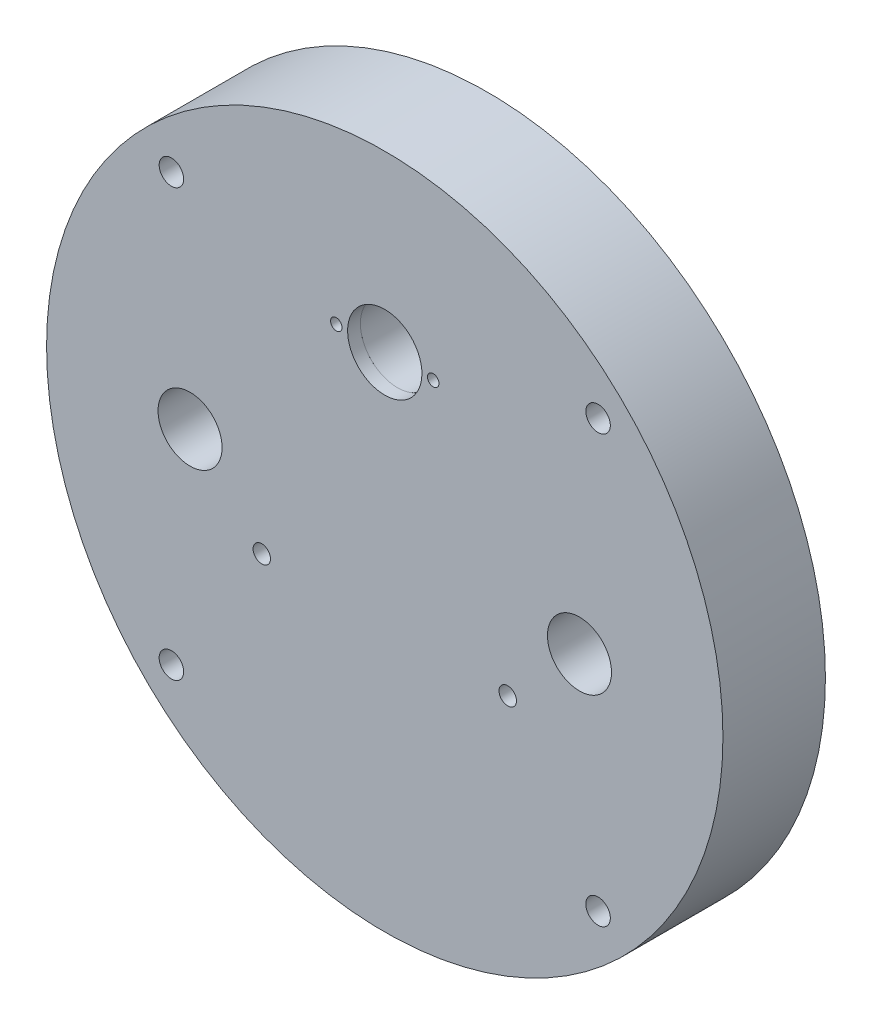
ISO-10303-21;
HEADER;
FILE_DESCRIPTION(('STEP AP214'),'2;1');
FILE_NAME('part.step','',(''),(''),'','','');
FILE_SCHEMA(('AUTOMOTIVE_DESIGN { 1 0 10303 214 1 1 1 1 }'));
ENDSEC;
DATA;
#1=APPLICATION_CONTEXT('core data for automotive mechanical design processes');
#2=APPLICATION_PROTOCOL_DEFINITION('international standard','automotive_design',2000,#1);
#3=PRODUCT_CONTEXT('',#1,'mechanical');
#4=PRODUCT('Part','Part','',(#3));
#5=PRODUCT_RELATED_PRODUCT_CATEGORY('part','',(#4));
#6=PRODUCT_DEFINITION_FORMATION('','',#4);
#7=PRODUCT_DEFINITION_CONTEXT('part definition',#1,'design');
#8=PRODUCT_DEFINITION('design','',#6,#7);
#9=PRODUCT_DEFINITION_SHAPE('','',#8);
#10=(LENGTH_UNIT() NAMED_UNIT(*) SI_UNIT(.MILLI.,.METRE.));
#11=(NAMED_UNIT(*) PLANE_ANGLE_UNIT() SI_UNIT($,.RADIAN.));
#12=(NAMED_UNIT(*) SI_UNIT($,.STERADIAN.) SOLID_ANGLE_UNIT());
#13=UNCERTAINTY_MEASURE_WITH_UNIT(LENGTH_MEASURE(1.E-05),#10,'distance_accuracy_value','');
#14=(GEOMETRIC_REPRESENTATION_CONTEXT(3) GLOBAL_UNCERTAINTY_ASSIGNED_CONTEXT((#13)) GLOBAL_UNIT_ASSIGNED_CONTEXT((#10,
#11,#12)) REPRESENTATION_CONTEXT('',''));
#15=CARTESIAN_POINT('',(0.,0.,0.));
#16=DIRECTION('',(0.,0.,1.));
#17=DIRECTION('',(1.,0.,0.));
#18=AXIS2_PLACEMENT_3D('',#15,#16,#17);
#19=CARTESIAN_POINT('',(0.,0.,15.875));
#20=DIRECTION('',(0.,0.,-1.));
#21=DIRECTION('',(-1.,0.,0.));
#22=AXIS2_PLACEMENT_3D('',#19,#20,#21);
#23=CYLINDRICAL_SURFACE('',#22,52.3875);
#24=CARTESIAN_POINT('',(0.,0.,15.875));
#25=DIRECTION('',(0.,0.,1.));
#26=DIRECTION('',(1.,0.,0.));
#27=AXIS2_PLACEMENT_3D('',#24,#25,#26);
#28=CIRCLE('',#27,52.3875);
#29=CARTESIAN_POINT('',(52.3875,0.,15.875));
#30=VERTEX_POINT('',#29);
#31=EDGE_CURVE('E11',#30,#30,#28,.T.);
#32=ORIENTED_EDGE('',*,*,#31,.F.);
#33=EDGE_LOOP('',(#32));
#34=FACE_BOUND('',#33,.T.);
#35=CARTESIAN_POINT('',(0.,0.,0.));
#36=DIRECTION('',(0.,0.,1.));
#37=DIRECTION('',(1.,0.,0.));
#38=AXIS2_PLACEMENT_3D('',#35,#36,#37);
#39=CIRCLE('',#38,52.3875);
#40=CARTESIAN_POINT('',(52.3875,0.,0.));
#41=VERTEX_POINT('',#40);
#42=EDGE_CURVE('E42',#41,#41,#39,.T.);
#43=ORIENTED_EDGE('',*,*,#42,.T.);
#44=EDGE_LOOP('',(#43));
#45=FACE_BOUND('',#44,.T.);
#46=ADVANCED_FACE('F39',(#34,#45),#23,.T.);
#47=CARTESIAN_POINT('',(0.,0.,15.875));
#48=DIRECTION('',(0.,0.,1.));
#49=DIRECTION('',(1.,0.,0.));
#50=AXIS2_PLACEMENT_3D('',#47,#48,#49);
#51=PLANE('',#50);
#52=CARTESIAN_POINT('',(-7.5057,25.4,15.875));
#53=DIRECTION('',(0.,0.,1.));
#54=DIRECTION('',(1.,0.,0.));
#55=AXIS2_PLACEMENT_3D('',#52,#53,#54);
#56=CIRCLE('',#55,0.888999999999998);
#57=CARTESIAN_POINT('',(-6.6167,25.4,15.875));
#58=VERTEX_POINT('',#57);
#59=EDGE_CURVE('E79',#58,#58,#56,.T.);
#60=ORIENTED_EDGE('',*,*,#59,.F.);
#61=EDGE_LOOP('',(#60));
#62=FACE_BOUND('',#61,.T.);
#63=CARTESIAN_POINT('',(7.5057,25.4,15.875));
#64=DIRECTION('',(0.,0.,1.));
#65=DIRECTION('',(1.,0.,0.));
#66=AXIS2_PLACEMENT_3D('',#63,#64,#65);
#67=CIRCLE('',#66,0.888999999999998);
#68=CARTESIAN_POINT('',(8.3947,25.4,15.875));
#69=VERTEX_POINT('',#68);
#70=EDGE_CURVE('E78',#69,#69,#67,.T.);
#71=ORIENTED_EDGE('',*,*,#70,.F.);
#72=EDGE_LOOP('',(#71));
#73=FACE_BOUND('',#72,.T.);
#74=CARTESIAN_POINT('',(0.,25.4,15.875));
#75=DIRECTION('',(0.,0.,-1.));
#76=DIRECTION('',(0.,1.,0.));
#77=AXIS2_PLACEMENT_3D('',#74,#75,#76);
#78=CIRCLE('',#77,5.7546875);
#79=CARTESIAN_POINT('',(0.,31.1546875,15.875));
#80=VERTEX_POINT('',#79);
#81=EDGE_CURVE('E90',#80,#80,#78,.T.);
#82=ORIENTED_EDGE('',*,*,#81,.T.);
#83=EDGE_LOOP('',(#82));
#84=FACE_BOUND('',#83,.T.);
#85=CARTESIAN_POINT('',(-19.05,-11.16584,15.875));
#86=DIRECTION('',(0.,0.,1.));
#87=DIRECTION('',(1.,0.,0.));
#88=AXIS2_PLACEMENT_3D('',#85,#86,#87);
#89=CIRCLE('',#88,1.35255);
#90=CARTESIAN_POINT('',(-17.69745,-11.16584,15.875));
#91=VERTEX_POINT('',#90);
#92=EDGE_CURVE('E107',#91,#91,#89,.T.);
#93=ORIENTED_EDGE('',*,*,#92,.F.);
#94=EDGE_LOOP('',(#93));
#95=FACE_BOUND('',#94,.T.);
#96=CARTESIAN_POINT('',(19.05,-11.16584,15.875));
#97=DIRECTION('',(0.,0.,1.));
#98=DIRECTION('',(1.,0.,0.));
#99=AXIS2_PLACEMENT_3D('',#96,#97,#98);
#100=CIRCLE('',#99,1.35255);
#101=CARTESIAN_POINT('',(20.40255,-11.16584,15.875));
#102=VERTEX_POINT('',#101);
#103=EDGE_CURVE('E113',#102,#102,#100,.T.);
#104=ORIENTED_EDGE('',*,*,#103,.F.);
#105=EDGE_LOOP('',(#104));
#106=FACE_BOUND('',#105,.T.);
#107=CARTESIAN_POINT('',(-30.1625,0.,15.875));
#108=DIRECTION('',(0.,0.,1.));
#109=DIRECTION('',(1.,0.,0.));
#110=AXIS2_PLACEMENT_3D('',#107,#108,#109);
#111=CIRCLE('',#110,4.96061999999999);
#112=CARTESIAN_POINT('',(-25.20188,0.,15.875));
#113=VERTEX_POINT('',#112);
#114=EDGE_CURVE('E137',#113,#113,#111,.T.);
#115=ORIENTED_EDGE('',*,*,#114,.F.);
#116=EDGE_LOOP('',(#115));
#117=FACE_BOUND('',#116,.T.);
#118=CARTESIAN_POINT('',(30.1625,0.,15.875));
#119=DIRECTION('',(0.,0.,1.));
#120=DIRECTION('',(1.,0.,0.));
#121=AXIS2_PLACEMENT_3D('',#118,#119,#120);
#122=CIRCLE('',#121,4.96061999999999);
#123=CARTESIAN_POINT('',(35.12312,0.,15.875));
#124=VERTEX_POINT('',#123);
#125=EDGE_CURVE('E143',#124,#124,#122,.T.);
#126=ORIENTED_EDGE('',*,*,#125,.F.);
#127=EDGE_LOOP('',(#126));
#128=FACE_BOUND('',#127,.T.);
#129=CARTESIAN_POINT('',(-33.0473425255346,-33.0473425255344,15.875));
#130=DIRECTION('',(0.,0.,-1.));
#131=DIRECTION('',(-1.,0.,0.));
#132=AXIS2_PLACEMENT_3D('',#129,#130,#131);
#133=CIRCLE('',#132,1.89864999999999);
#134=CARTESIAN_POINT('',(-34.9459925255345,-33.0473425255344,15.875));
#135=VERTEX_POINT('',#134);
#136=EDGE_CURVE('E152',#135,#135,#133,.T.);
#137=ORIENTED_EDGE('',*,*,#136,.T.);
#138=EDGE_LOOP('',(#137));
#139=FACE_BOUND('',#138,.T.);
#140=CARTESIAN_POINT('',(33.0473425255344,-33.0473425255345,15.875));
#141=DIRECTION('',(0.,0.,-1.));
#142=DIRECTION('',(-1.,0.,0.));
#143=AXIS2_PLACEMENT_3D('',#140,#141,#142);
#144=CIRCLE('',#143,1.89864999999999);
#145=CARTESIAN_POINT('',(31.1486925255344,-33.0473425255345,15.875));
#146=VERTEX_POINT('',#145);
#147=EDGE_CURVE('E158',#146,#146,#144,.T.);
#148=ORIENTED_EDGE('',*,*,#147,.T.);
#149=EDGE_LOOP('',(#148));
#150=FACE_BOUND('',#149,.T.);
#151=CARTESIAN_POINT('',(33.0473425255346,33.0473425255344,15.875));
#152=DIRECTION('',(0.,0.,-1.));
#153=DIRECTION('',(-1.,0.,0.));
#154=AXIS2_PLACEMENT_3D('',#151,#152,#153);
#155=CIRCLE('',#154,1.89864999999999);
#156=CARTESIAN_POINT('',(31.1486925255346,33.0473425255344,15.875));
#157=VERTEX_POINT('',#156);
#158=EDGE_CURVE('E164',#157,#157,#155,.T.);
#159=ORIENTED_EDGE('',*,*,#158,.T.);
#160=EDGE_LOOP('',(#159));
#161=FACE_BOUND('',#160,.T.);
#162=CARTESIAN_POINT('',(-33.0473425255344,33.0473425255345,15.875));
#163=DIRECTION('',(0.,0.,-1.));
#164=DIRECTION('',(-1.,0.,0.));
#165=AXIS2_PLACEMENT_3D('',#162,#163,#164);
#166=CIRCLE('',#165,1.89864999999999);
#167=CARTESIAN_POINT('',(-34.9459925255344,33.0473425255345,15.875));
#168=VERTEX_POINT('',#167);
#169=EDGE_CURVE('E170',#168,#168,#166,.T.);
#170=ORIENTED_EDGE('',*,*,#169,.T.);
#171=EDGE_LOOP('',(#170));
#172=FACE_BOUND('',#171,.T.);
#173=ORIENTED_EDGE('',*,*,#31,.T.);
#174=EDGE_LOOP('',(#173));
#175=FACE_BOUND('',#174,.T.);
#176=ADVANCED_FACE('F181',(#62,#73,#84,#95,#106,#117,#128,#139,#150,#161,#172,#175),#51,.T.);
#177=CARTESIAN_POINT('',(0.,0.,0.));
#178=DIRECTION('',(0.,0.,1.));
#179=DIRECTION('',(1.,0.,0.));
#180=AXIS2_PLACEMENT_3D('',#177,#178,#179);
#181=PLANE('',#180);
#182=CARTESIAN_POINT('',(0.,25.4,0.));
#183=DIRECTION('',(0.,0.,-1.));
#184=DIRECTION('',(-1.,0.,0.));
#185=AXIS2_PLACEMENT_3D('',#182,#183,#184);
#186=CIRCLE('',#185,6.985);
#187=CARTESIAN_POINT('',(-6.985,25.4,0.));
#188=VERTEX_POINT('',#187);
#189=EDGE_CURVE('E98',#188,#188,#186,.T.);
#190=ORIENTED_EDGE('',*,*,#189,.F.);
#191=EDGE_LOOP('',(#190));
#192=FACE_BOUND('',#191,.T.);
#193=CARTESIAN_POINT('',(19.05,-31.7499999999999,0.));
#194=DIRECTION('',(0.,0.,-1.));
#195=DIRECTION('',(-1.,0.,0.));
#196=AXIS2_PLACEMENT_3D('',#193,#194,#195);
#197=CIRCLE('',#196,2.5527);
#198=CARTESIAN_POINT('',(16.4973,-31.7499999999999,0.));
#199=VERTEX_POINT('',#198);
#200=EDGE_CURVE('E119',#199,#199,#197,.T.);
#201=ORIENTED_EDGE('',*,*,#200,.F.);
#202=EDGE_LOOP('',(#201));
#203=FACE_BOUND('',#202,.T.);
#204=CARTESIAN_POINT('',(0.,-31.75,0.));
#205=DIRECTION('',(0.,0.,-1.));
#206=DIRECTION('',(-1.,0.,0.));
#207=AXIS2_PLACEMENT_3D('',#204,#205,#206);
#208=CIRCLE('',#207,2.5527);
#209=CARTESIAN_POINT('',(-2.55270000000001,-31.75,0.));
#210=VERTEX_POINT('',#209);
#211=EDGE_CURVE('E125',#210,#210,#208,.T.);
#212=ORIENTED_EDGE('',*,*,#211,.F.);
#213=EDGE_LOOP('',(#212));
#214=FACE_BOUND('',#213,.T.);
#215=CARTESIAN_POINT('',(-19.05,-31.7500000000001,0.));
#216=DIRECTION('',(0.,0.,-1.));
#217=DIRECTION('',(-1.,0.,0.));
#218=AXIS2_PLACEMENT_3D('',#215,#216,#217);
#219=CIRCLE('',#218,2.5527);
#220=CARTESIAN_POINT('',(-21.6027,-31.7500000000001,0.));
#221=VERTEX_POINT('',#220);
#222=EDGE_CURVE('E131',#221,#221,#219,.T.);
#223=ORIENTED_EDGE('',*,*,#222,.F.);
#224=EDGE_LOOP('',(#223));
#225=FACE_BOUND('',#224,.T.);
#226=CARTESIAN_POINT('',(-30.1625,0.,0.));
#227=DIRECTION('',(0.,0.,1.));
#228=DIRECTION('',(1.,0.,0.));
#229=AXIS2_PLACEMENT_3D('',#226,#227,#228);
#230=CIRCLE('',#229,4.96061999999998);
#231=CARTESIAN_POINT('',(-25.20188,0.,0.));
#232=VERTEX_POINT('',#231);
#233=EDGE_CURVE('E140',#232,#232,#230,.T.);
#234=ORIENTED_EDGE('',*,*,#233,.T.);
#235=EDGE_LOOP('',(#234));
#236=FACE_BOUND('',#235,.T.);
#237=CARTESIAN_POINT('',(30.1625,0.,0.));
#238=DIRECTION('',(0.,0.,1.));
#239=DIRECTION('',(1.,0.,0.));
#240=AXIS2_PLACEMENT_3D('',#237,#238,#239);
#241=CIRCLE('',#240,4.96061999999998);
#242=CARTESIAN_POINT('',(35.12312,0.,0.));
#243=VERTEX_POINT('',#242);
#244=EDGE_CURVE('E146',#243,#243,#241,.T.);
#245=ORIENTED_EDGE('',*,*,#244,.T.);
#246=EDGE_LOOP('',(#245));
#247=FACE_BOUND('',#246,.T.);
#248=CARTESIAN_POINT('',(-33.0473425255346,-33.0473425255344,0.));
#249=DIRECTION('',(0.,0.,-1.));
#250=DIRECTION('',(-1.,0.,0.));
#251=AXIS2_PLACEMENT_3D('',#248,#249,#250);
#252=CIRCLE('',#251,1.89865);
#253=CARTESIAN_POINT('',(-34.9459925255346,-33.0473425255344,0.));
#254=VERTEX_POINT('',#253);
#255=EDGE_CURVE('E149',#254,#254,#252,.T.);
#256=ORIENTED_EDGE('',*,*,#255,.F.);
#257=EDGE_LOOP('',(#256));
#258=FACE_BOUND('',#257,.T.);
#259=CARTESIAN_POINT('',(33.0473425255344,-33.0473425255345,0.));
#260=DIRECTION('',(0.,0.,-1.));
#261=DIRECTION('',(-1.,0.,0.));
#262=AXIS2_PLACEMENT_3D('',#259,#260,#261);
#263=CIRCLE('',#262,1.89864999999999);
#264=CARTESIAN_POINT('',(31.1486925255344,-33.0473425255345,0.));
#265=VERTEX_POINT('',#264);
#266=EDGE_CURVE('E155',#265,#265,#263,.T.);
#267=ORIENTED_EDGE('',*,*,#266,.F.);
#268=EDGE_LOOP('',(#267));
#269=FACE_BOUND('',#268,.T.);
#270=CARTESIAN_POINT('',(33.0473425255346,33.0473425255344,0.));
#271=DIRECTION('',(0.,0.,-1.));
#272=DIRECTION('',(-1.,0.,0.));
#273=AXIS2_PLACEMENT_3D('',#270,#271,#272);
#274=CIRCLE('',#273,1.89864999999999);
#275=CARTESIAN_POINT('',(31.1486925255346,33.0473425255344,0.));
#276=VERTEX_POINT('',#275);
#277=EDGE_CURVE('E161',#276,#276,#274,.T.);
#278=ORIENTED_EDGE('',*,*,#277,.F.);
#279=EDGE_LOOP('',(#278));
#280=FACE_BOUND('',#279,.T.);
#281=CARTESIAN_POINT('',(-33.0473425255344,33.0473425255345,0.));
#282=DIRECTION('',(0.,0.,-1.));
#283=DIRECTION('',(-1.,0.,0.));
#284=AXIS2_PLACEMENT_3D('',#281,#282,#283);
#285=CIRCLE('',#284,1.89865);
#286=CARTESIAN_POINT('',(-34.9459925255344,33.0473425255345,0.));
#287=VERTEX_POINT('',#286);
#288=EDGE_CURVE('E167',#287,#287,#285,.T.);
#289=ORIENTED_EDGE('',*,*,#288,.F.);
#290=EDGE_LOOP('',(#289));
#291=FACE_BOUND('',#290,.T.);
#292=ORIENTED_EDGE('',*,*,#42,.F.);
#293=EDGE_LOOP('',(#292));
#294=FACE_BOUND('',#293,.T.);
#295=ADVANCED_FACE('F178',(#192,#203,#214,#225,#236,#247,#258,#269,#280,#291,#294),#181,.F.);
#296=CARTESIAN_POINT('',(-33.0473425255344,33.0473425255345,0.));
#297=DIRECTION('',(0.,0.,-1.));
#298=DIRECTION('',(-1.,0.,0.));
#299=AXIS2_PLACEMENT_3D('',#296,#297,#298);
#300=CYLINDRICAL_SURFACE('',#299,1.89865);
#301=ORIENTED_EDGE('',*,*,#169,.F.);
#302=EDGE_LOOP('',(#301));
#303=FACE_BOUND('',#302,.T.);
#304=ORIENTED_EDGE('',*,*,#288,.T.);
#305=EDGE_LOOP('',(#304));
#306=FACE_BOUND('',#305,.T.);
#307=ADVANCED_FACE('F180',(#303,#306),#300,.F.);
#308=CARTESIAN_POINT('',(33.0473425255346,33.0473425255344,0.));
#309=DIRECTION('',(0.,0.,-1.));
#310=DIRECTION('',(-1.,0.,0.));
#311=AXIS2_PLACEMENT_3D('',#308,#309,#310);
#312=CYLINDRICAL_SURFACE('',#311,1.89864999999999);
#313=ORIENTED_EDGE('',*,*,#158,.F.);
#314=EDGE_LOOP('',(#313));
#315=FACE_BOUND('',#314,.T.);
#316=ORIENTED_EDGE('',*,*,#277,.T.);
#317=EDGE_LOOP('',(#316));
#318=FACE_BOUND('',#317,.T.);
#319=ADVANCED_FACE('F187',(#315,#318),#312,.F.);
#320=CARTESIAN_POINT('',(33.0473425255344,-33.0473425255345,0.));
#321=DIRECTION('',(0.,0.,-1.));
#322=DIRECTION('',(-1.,0.,0.));
#323=AXIS2_PLACEMENT_3D('',#320,#321,#322);
#324=CYLINDRICAL_SURFACE('',#323,1.89864999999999);
#325=ORIENTED_EDGE('',*,*,#147,.F.);
#326=EDGE_LOOP('',(#325));
#327=FACE_BOUND('',#326,.T.);
#328=ORIENTED_EDGE('',*,*,#266,.T.);
#329=EDGE_LOOP('',(#328));
#330=FACE_BOUND('',#329,.T.);
#331=ADVANCED_FACE('F319',(#327,#330),#324,.F.);
#332=CARTESIAN_POINT('',(-33.0473425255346,-33.0473425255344,0.));
#333=DIRECTION('',(0.,0.,-1.));
#334=DIRECTION('',(-1.,0.,0.));
#335=AXIS2_PLACEMENT_3D('',#332,#333,#334);
#336=CYLINDRICAL_SURFACE('',#335,1.89865);
#337=ORIENTED_EDGE('',*,*,#136,.F.);
#338=EDGE_LOOP('',(#337));
#339=FACE_BOUND('',#338,.T.);
#340=ORIENTED_EDGE('',*,*,#255,.T.);
#341=EDGE_LOOP('',(#340));
#342=FACE_BOUND('',#341,.T.);
#343=ADVANCED_FACE('F315',(#339,#342),#336,.F.);
#344=CARTESIAN_POINT('',(30.1625,0.,15.875));
#345=DIRECTION('',(0.,0.,1.));
#346=DIRECTION('',(1.,0.,0.));
#347=AXIS2_PLACEMENT_3D('',#344,#345,#346);
#348=CYLINDRICAL_SURFACE('',#347,4.96061999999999);
#349=ORIENTED_EDGE('',*,*,#244,.F.);
#350=EDGE_LOOP('',(#349));
#351=FACE_BOUND('',#350,.T.);
#352=ORIENTED_EDGE('',*,*,#125,.T.);
#353=EDGE_LOOP('',(#352));
#354=FACE_BOUND('',#353,.T.);
#355=ADVANCED_FACE('F311',(#351,#354),#348,.F.);
#356=CARTESIAN_POINT('',(-30.1625,0.,15.875));
#357=DIRECTION('',(0.,0.,1.));
#358=DIRECTION('',(1.,0.,0.));
#359=AXIS2_PLACEMENT_3D('',#356,#357,#358);
#360=CYLINDRICAL_SURFACE('',#359,4.96061999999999);
#361=ORIENTED_EDGE('',*,*,#233,.F.);
#362=EDGE_LOOP('',(#361));
#363=FACE_BOUND('',#362,.T.);
#364=ORIENTED_EDGE('',*,*,#114,.T.);
#365=EDGE_LOOP('',(#364));
#366=FACE_BOUND('',#365,.T.);
#367=ADVANCED_FACE('F308',(#363,#366),#360,.F.);
#368=CARTESIAN_POINT('',(-19.05,-31.7500000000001,12.7));
#369=DIRECTION('',(0.,0.,-1.));
#370=DIRECTION('',(-1.,0.,0.));
#371=AXIS2_PLACEMENT_3D('',#368,#369,#370);
#372=CONICAL_SURFACE('',#371,2.5527,1.02974425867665);
#373=CARTESIAN_POINT('',(-19.05,-31.7500000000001,14.2338169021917));
#374=VERTEX_POINT('',#373);
#375=VERTEX_LOOP('',#374);
#376=FACE_BOUND('',#375,.T.);
#377=CARTESIAN_POINT('',(-19.05,-31.7500000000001,12.7));
#378=DIRECTION('',(0.,0.,-1.));
#379=DIRECTION('',(-1.,0.,0.));
#380=AXIS2_PLACEMENT_3D('',#377,#378,#379);
#381=CIRCLE('',#380,2.5527);
#382=CARTESIAN_POINT('',(-21.6027,-31.7500000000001,12.7));
#383=VERTEX_POINT('',#382);
#384=EDGE_CURVE('E134',#383,#383,#381,.T.);
#385=ORIENTED_EDGE('',*,*,#384,.T.);
#386=EDGE_LOOP('',(#385));
#387=FACE_BOUND('',#386,.T.);
#388=ADVANCED_FACE('F304',(#376,#387),#372,.F.);
#389=CARTESIAN_POINT('',(-19.05,-31.7500000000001,0.));
#390=DIRECTION('',(0.,0.,-1.));
#391=DIRECTION('',(-1.,0.,0.));
#392=AXIS2_PLACEMENT_3D('',#389,#390,#391);
#393=CYLINDRICAL_SURFACE('',#392,2.5527);
#394=ORIENTED_EDGE('',*,*,#384,.F.);
#395=EDGE_LOOP('',(#394));
#396=FACE_BOUND('',#395,.T.);
#397=ORIENTED_EDGE('',*,*,#222,.T.);
#398=EDGE_LOOP('',(#397));
#399=FACE_BOUND('',#398,.T.);
#400=ADVANCED_FACE('F301',(#396,#399),#393,.F.);
#401=CARTESIAN_POINT('',(0.,-31.75,12.7));
#402=DIRECTION('',(0.,0.,-1.));
#403=DIRECTION('',(-1.,0.,0.));
#404=AXIS2_PLACEMENT_3D('',#401,#402,#403);
#405=CONICAL_SURFACE('',#404,2.5527,1.02974425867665);
#406=CARTESIAN_POINT('',(0.,-31.75,14.2338169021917));
#407=VERTEX_POINT('',#406);
#408=VERTEX_LOOP('',#407);
#409=FACE_BOUND('',#408,.T.);
#410=CARTESIAN_POINT('',(0.,-31.75,12.7));
#411=DIRECTION('',(0.,0.,-1.));
#412=DIRECTION('',(-1.,0.,0.));
#413=AXIS2_PLACEMENT_3D('',#410,#411,#412);
#414=CIRCLE('',#413,2.5527);
#415=CARTESIAN_POINT('',(-2.5527,-31.75,12.7));
#416=VERTEX_POINT('',#415);
#417=EDGE_CURVE('E128',#416,#416,#414,.T.);
#418=ORIENTED_EDGE('',*,*,#417,.T.);
#419=EDGE_LOOP('',(#418));
#420=FACE_BOUND('',#419,.T.);
#421=ADVANCED_FACE('F297',(#409,#420),#405,.F.);
#422=CARTESIAN_POINT('',(0.,-31.75,0.));
#423=DIRECTION('',(0.,0.,-1.));
#424=DIRECTION('',(-1.,0.,0.));
#425=AXIS2_PLACEMENT_3D('',#422,#423,#424);
#426=CYLINDRICAL_SURFACE('',#425,2.5527);
#427=ORIENTED_EDGE('',*,*,#417,.F.);
#428=EDGE_LOOP('',(#427));
#429=FACE_BOUND('',#428,.T.);
#430=ORIENTED_EDGE('',*,*,#211,.T.);
#431=EDGE_LOOP('',(#430));
#432=FACE_BOUND('',#431,.T.);
#433=ADVANCED_FACE('F293',(#429,#432),#426,.F.);
#434=CARTESIAN_POINT('',(19.05,-31.7499999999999,12.7));
#435=DIRECTION('',(0.,0.,-1.));
#436=DIRECTION('',(-1.,0.,0.));
#437=AXIS2_PLACEMENT_3D('',#434,#435,#436);
#438=CONICAL_SURFACE('',#437,2.5527,1.02974425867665);
#439=CARTESIAN_POINT('',(19.05,-31.7499999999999,14.2338169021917));
#440=VERTEX_POINT('',#439);
#441=VERTEX_LOOP('',#440);
#442=FACE_BOUND('',#441,.T.);
#443=CARTESIAN_POINT('',(19.05,-31.7499999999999,12.7));
#444=DIRECTION('',(0.,0.,-1.));
#445=DIRECTION('',(-1.,0.,0.));
#446=AXIS2_PLACEMENT_3D('',#443,#444,#445);
#447=CIRCLE('',#446,2.5527);
#448=CARTESIAN_POINT('',(16.4973,-31.7499999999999,12.7));
#449=VERTEX_POINT('',#448);
#450=EDGE_CURVE('E122',#449,#449,#447,.T.);
#451=ORIENTED_EDGE('',*,*,#450,.T.);
#452=EDGE_LOOP('',(#451));
#453=FACE_BOUND('',#452,.T.);
#454=ADVANCED_FACE('F289',(#442,#453),#438,.F.);
#455=CARTESIAN_POINT('',(19.05,-31.7499999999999,0.));
#456=DIRECTION('',(0.,0.,-1.));
#457=DIRECTION('',(-1.,0.,0.));
#458=AXIS2_PLACEMENT_3D('',#455,#456,#457);
#459=CYLINDRICAL_SURFACE('',#458,2.5527);
#460=ORIENTED_EDGE('',*,*,#450,.F.);
#461=EDGE_LOOP('',(#460));
#462=FACE_BOUND('',#461,.T.);
#463=ORIENTED_EDGE('',*,*,#200,.T.);
#464=EDGE_LOOP('',(#463));
#465=FACE_BOUND('',#464,.T.);
#466=ADVANCED_FACE('F285',(#462,#465),#459,.F.);
#467=CARTESIAN_POINT('',(19.05,-11.16584,3.175));
#468=DIRECTION('',(0.,0.,1.));
#469=DIRECTION('',(1.,0.,0.));
#470=AXIS2_PLACEMENT_3D('',#467,#468,#469);
#471=CONICAL_SURFACE('',#470,1.35255,1.02974425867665);
#472=CARTESIAN_POINT('',(19.05,-11.16584,2.36230596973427));
#473=VERTEX_POINT('',#472);
#474=VERTEX_LOOP('',#473);
#475=FACE_BOUND('',#474,.T.);
#476=CARTESIAN_POINT('',(19.05,-11.16584,3.175));
#477=DIRECTION('',(0.,0.,1.));
#478=DIRECTION('',(1.,0.,0.));
#479=AXIS2_PLACEMENT_3D('',#476,#477,#478);
#480=CIRCLE('',#479,1.35255);
#481=CARTESIAN_POINT('',(20.40255,-11.16584,3.175));
#482=VERTEX_POINT('',#481);
#483=EDGE_CURVE('E116',#482,#482,#480,.T.);
#484=ORIENTED_EDGE('',*,*,#483,.T.);
#485=EDGE_LOOP('',(#484));
#486=FACE_BOUND('',#485,.T.);
#487=ADVANCED_FACE('F281',(#475,#486),#471,.F.);
#488=CARTESIAN_POINT('',(19.05,-11.16584,15.875));
#489=DIRECTION('',(0.,0.,1.));
#490=DIRECTION('',(1.,0.,0.));
#491=AXIS2_PLACEMENT_3D('',#488,#489,#490);
#492=CYLINDRICAL_SURFACE('',#491,1.35255);
#493=ORIENTED_EDGE('',*,*,#483,.F.);
#494=EDGE_LOOP('',(#493));
#495=FACE_BOUND('',#494,.T.);
#496=ORIENTED_EDGE('',*,*,#103,.T.);
#497=EDGE_LOOP('',(#496));
#498=FACE_BOUND('',#497,.T.);
#499=ADVANCED_FACE('F277',(#495,#498),#492,.F.);
#500=CARTESIAN_POINT('',(-19.05,-11.16584,3.175));
#501=DIRECTION('',(0.,0.,1.));
#502=DIRECTION('',(1.,0.,0.));
#503=AXIS2_PLACEMENT_3D('',#500,#501,#502);
#504=CONICAL_SURFACE('',#503,1.35255,1.02974425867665);
#505=CARTESIAN_POINT('',(-19.05,-11.16584,2.36230596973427));
#506=VERTEX_POINT('',#505);
#507=VERTEX_LOOP('',#506);
#508=FACE_BOUND('',#507,.T.);
#509=CARTESIAN_POINT('',(-19.05,-11.16584,3.175));
#510=DIRECTION('',(0.,0.,1.));
#511=DIRECTION('',(1.,0.,0.));
#512=AXIS2_PLACEMENT_3D('',#509,#510,#511);
#513=CIRCLE('',#512,1.35255);
#514=CARTESIAN_POINT('',(-17.69745,-11.16584,3.175));
#515=VERTEX_POINT('',#514);
#516=EDGE_CURVE('E110',#515,#515,#513,.T.);
#517=ORIENTED_EDGE('',*,*,#516,.T.);
#518=EDGE_LOOP('',(#517));
#519=FACE_BOUND('',#518,.T.);
#520=ADVANCED_FACE('F273',(#508,#519),#504,.F.);
#521=CARTESIAN_POINT('',(-19.05,-11.16584,15.875));
#522=DIRECTION('',(0.,0.,1.));
#523=DIRECTION('',(1.,0.,0.));
#524=AXIS2_PLACEMENT_3D('',#521,#522,#523);
#525=CYLINDRICAL_SURFACE('',#524,1.35255);
#526=ORIENTED_EDGE('',*,*,#516,.F.);
#527=EDGE_LOOP('',(#526));
#528=FACE_BOUND('',#527,.T.);
#529=ORIENTED_EDGE('',*,*,#92,.T.);
#530=EDGE_LOOP('',(#529));
#531=FACE_BOUND('',#530,.T.);
#532=ADVANCED_FACE('F269',(#528,#531),#525,.F.);
#533=CARTESIAN_POINT('',(0.,25.4,0.));
#534=DIRECTION('',(0.,0.,-1.));
#535=DIRECTION('',(-1.,0.,0.));
#536=AXIS2_PLACEMENT_3D('',#533,#534,#535);
#537=CYLINDRICAL_SURFACE('',#536,5.7531);
#538=CARTESIAN_POINT('',(0.,25.4,13.8938));
#539=DIRECTION('',(0.,0.,-1.));
#540=DIRECTION('',(0.,1.,0.));
#541=AXIS2_PLACEMENT_3D('',#538,#539,#540);
#542=CIRCLE('',#541,5.7531);
#543=CARTESIAN_POINT('',(0.,31.1531,13.8938));
#544=VERTEX_POINT('',#543);
#545=EDGE_CURVE('E93',#544,#544,#542,.F.);
#546=ORIENTED_EDGE('',*,*,#545,.T.);
#547=EDGE_LOOP('',(#546));
#548=FACE_BOUND('',#547,.T.);
#549=CARTESIAN_POINT('',(0.,25.4,3.09199889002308));
#550=DIRECTION('',(0.,0.,-1.));
#551=DIRECTION('',(-1.,0.,0.));
#552=AXIS2_PLACEMENT_3D('',#549,#550,#551);
#553=CIRCLE('',#552,5.7531);
#554=CARTESIAN_POINT('',(-5.7531,25.4,3.09199889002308));
#555=VERTEX_POINT('',#554);
#556=EDGE_CURVE('E104',#555,#555,#553,.T.);
#557=ORIENTED_EDGE('',*,*,#556,.T.);
#558=EDGE_LOOP('',(#557));
#559=FACE_BOUND('',#558,.T.);
#560=ADVANCED_FACE('F265',(#548,#559),#537,.F.);
#561=CARTESIAN_POINT('',(0.,25.4,2.3622));
#562=DIRECTION('',(0.,0.,-1.));
#563=DIRECTION('',(-1.,0.,0.));
#564=AXIS2_PLACEMENT_3D('',#561,#562,#563);
#565=CONICAL_SURFACE('',#564,6.48289889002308,0.785398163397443);
#566=ORIENTED_EDGE('',*,*,#556,.F.);
#567=EDGE_LOOP('',(#566));
#568=FACE_BOUND('',#567,.T.);
#569=CARTESIAN_POINT('',(0.,25.4,2.3622));
#570=DIRECTION('',(0.,0.,-1.));
#571=DIRECTION('',(-1.,0.,0.));
#572=AXIS2_PLACEMENT_3D('',#569,#570,#571);
#573=CIRCLE('',#572,6.48289889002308);
#574=CARTESIAN_POINT('',(-6.48289889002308,25.4,2.3622));
#575=VERTEX_POINT('',#574);
#576=EDGE_CURVE('E101',#575,#575,#573,.T.);
#577=ORIENTED_EDGE('',*,*,#576,.T.);
#578=EDGE_LOOP('',(#577));
#579=FACE_BOUND('',#578,.T.);
#580=ADVANCED_FACE('F261',(#568,#579),#565,.F.);
#581=CARTESIAN_POINT('',(0.,25.4,0.));
#582=DIRECTION('',(0.,0.,-1.));
#583=DIRECTION('',(-1.,0.,0.));
#584=AXIS2_PLACEMENT_3D('',#581,#582,#583);
#585=CONICAL_SURFACE('',#584,6.985,0.209439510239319);
#586=ORIENTED_EDGE('',*,*,#576,.F.);
#587=EDGE_LOOP('',(#586));
#588=FACE_BOUND('',#587,.T.);
#589=ORIENTED_EDGE('',*,*,#189,.T.);
#590=EDGE_LOOP('',(#589));
#591=FACE_BOUND('',#590,.T.);
#592=ADVANCED_FACE('F255',(#588,#591),#585,.F.);
#593=CARTESIAN_POINT('',(0.,25.4,13.8938));
#594=DIRECTION('',(0.,0.,-1.));
#595=DIRECTION('',(0.,1.,0.));
#596=AXIS2_PLACEMENT_3D('',#593,#594,#595);
#597=PLANE('',#596);
#598=CARTESIAN_POINT('',(0.,25.4,13.8938));
#599=DIRECTION('',(0.,0.,-1.));
#600=DIRECTION('',(0.,1.,0.));
#601=AXIS2_PLACEMENT_3D('',#598,#599,#600);
#602=CIRCLE('',#601,5.7546875);
#603=CARTESIAN_POINT('',(0.,31.1546875,13.8938));
#604=VERTEX_POINT('',#603);
#605=EDGE_CURVE('E89',#604,#604,#602,.T.);
#606=ORIENTED_EDGE('',*,*,#605,.F.);
#607=EDGE_LOOP('',(#606));
#608=FACE_BOUND('',#607,.T.);
#609=ORIENTED_EDGE('',*,*,#545,.F.);
#610=EDGE_LOOP('',(#609));
#611=FACE_BOUND('',#610,.T.);
#612=ADVANCED_FACE('F252',(#608,#611),#597,.F.);
#613=CARTESIAN_POINT('',(0.,25.4,15.875));
#614=DIRECTION('',(0.,0.,-1.));
#615=DIRECTION('',(0.,1.,0.));
#616=AXIS2_PLACEMENT_3D('',#613,#614,#615);
#617=CYLINDRICAL_SURFACE('',#616,5.7546875);
#618=ORIENTED_EDGE('',*,*,#81,.F.);
#619=EDGE_LOOP('',(#618));
#620=FACE_BOUND('',#619,.T.);
#621=ORIENTED_EDGE('',*,*,#605,.T.);
#622=EDGE_LOOP('',(#621));
#623=FACE_BOUND('',#622,.T.);
#624=ADVANCED_FACE('F212',(#620,#623),#617,.F.);
#625=CARTESIAN_POINT('',(7.5057,25.4,7.239));
#626=DIRECTION('',(0.,0.,1.));
#627=DIRECTION('',(1.,0.,0.));
#628=AXIS2_PLACEMENT_3D('',#625,#626,#627);
#629=CONICAL_SURFACE('',#628,0.888999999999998,1.02974425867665);
#630=CARTESIAN_POINT('',(7.5057,25.4,6.7048349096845));
#631=VERTEX_POINT('',#630);
#632=VERTEX_LOOP('',#631);
#633=FACE_BOUND('',#632,.T.);
#634=CARTESIAN_POINT('',(7.5057,25.4,7.239));
#635=DIRECTION('',(0.,0.,1.));
#636=DIRECTION('',(1.,0.,0.));
#637=AXIS2_PLACEMENT_3D('',#634,#635,#636);
#638=CIRCLE('',#637,0.888999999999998);
#639=CARTESIAN_POINT('',(8.3947,25.4,7.239));
#640=VERTEX_POINT('',#639);
#641=EDGE_CURVE('E82',#640,#640,#638,.T.);
#642=ORIENTED_EDGE('',*,*,#641,.T.);
#643=EDGE_LOOP('',(#642));
#644=FACE_BOUND('',#643,.T.);
#645=ADVANCED_FACE('F217',(#633,#644),#629,.F.);
#646=CARTESIAN_POINT('',(7.5057,25.4,15.875));
#647=DIRECTION('',(0.,0.,1.));
#648=DIRECTION('',(1.,0.,0.));
#649=AXIS2_PLACEMENT_3D('',#646,#647,#648);
#650=CYLINDRICAL_SURFACE('',#649,0.888999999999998);
#651=ORIENTED_EDGE('',*,*,#641,.F.);
#652=EDGE_LOOP('',(#651));
#653=FACE_BOUND('',#652,.T.);
#654=ORIENTED_EDGE('',*,*,#70,.T.);
#655=EDGE_LOOP('',(#654));
#656=FACE_BOUND('',#655,.T.);
#657=ADVANCED_FACE('F72',(#653,#656),#650,.F.);
#658=CARTESIAN_POINT('',(-7.5057,25.4,7.239));
#659=DIRECTION('',(0.,0.,1.));
#660=DIRECTION('',(1.,0.,0.));
#661=AXIS2_PLACEMENT_3D('',#658,#659,#660);
#662=CONICAL_SURFACE('',#661,0.888999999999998,1.02974425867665);
#663=CARTESIAN_POINT('',(-7.5057,25.4,6.7048349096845));
#664=VERTEX_POINT('',#663);
#665=VERTEX_LOOP('',#664);
#666=FACE_BOUND('',#665,.T.);
#667=CARTESIAN_POINT('',(-7.5057,25.4,7.239));
#668=DIRECTION('',(0.,0.,1.));
#669=DIRECTION('',(1.,0.,0.));
#670=AXIS2_PLACEMENT_3D('',#667,#668,#669);
#671=CIRCLE('',#670,0.888999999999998);
#672=CARTESIAN_POINT('',(-6.6167,25.4,7.239));
#673=VERTEX_POINT('',#672);
#674=EDGE_CURVE('E76',#673,#673,#671,.T.);
#675=ORIENTED_EDGE('',*,*,#674,.T.);
#676=EDGE_LOOP('',(#675));
#677=FACE_BOUND('',#676,.T.);
#678=ADVANCED_FACE('F68',(#666,#677),#662,.F.);
#679=CARTESIAN_POINT('',(-7.5057,25.4,15.875));
#680=DIRECTION('',(0.,0.,1.));
#681=DIRECTION('',(1.,0.,0.));
#682=AXIS2_PLACEMENT_3D('',#679,#680,#681);
#683=CYLINDRICAL_SURFACE('',#682,0.888999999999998);
#684=ORIENTED_EDGE('',*,*,#674,.F.);
#685=EDGE_LOOP('',(#684));
#686=FACE_BOUND('',#685,.T.);
#687=ORIENTED_EDGE('',*,*,#59,.T.);
#688=EDGE_LOOP('',(#687));
#689=FACE_BOUND('',#688,.T.);
#690=ADVANCED_FACE('F71',(#686,#689),#683,.F.);
#691=CLOSED_SHELL('',(#46,#176,#295,#307,#319,#331,#343,#355,#367,#388,#400,#421,#433,#454,#466,
#487,#499,#520,#532,#560,#580,#592,#612,#624,#645,#657,#678,#690));
#692=MANIFOLD_SOLID_BREP('B2',#691);
#693=ADVANCED_BREP_SHAPE_REPRESENTATION('',(#18,#692),#14);
#694=SHAPE_DEFINITION_REPRESENTATION(#9,#693);
ENDSEC;
END-ISO-10303-21;
